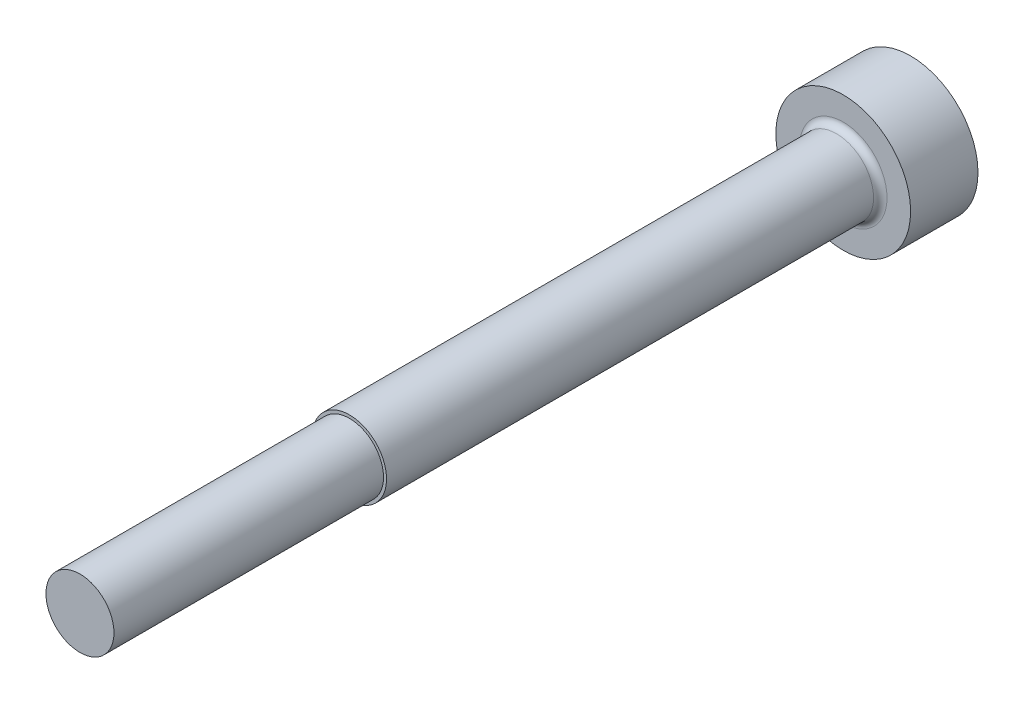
ISO-10303-21;
HEADER;
FILE_DESCRIPTION(('STEP AP214'),'2;1');
FILE_NAME('part.step','',(''),(''),'','','');
FILE_SCHEMA(('AUTOMOTIVE_DESIGN { 1 0 10303 214 1 1 1 1 }'));
ENDSEC;
DATA;
#1=APPLICATION_CONTEXT('core data for automotive mechanical design processes');
#2=APPLICATION_PROTOCOL_DEFINITION('international standard','automotive_design',2000,#1);
#3=PRODUCT_CONTEXT('',#1,'mechanical');
#4=PRODUCT('Part','Part','',(#3));
#5=PRODUCT_RELATED_PRODUCT_CATEGORY('part','',(#4));
#6=PRODUCT_DEFINITION_FORMATION('','',#4);
#7=PRODUCT_DEFINITION_CONTEXT('part definition',#1,'design');
#8=PRODUCT_DEFINITION('design','',#6,#7);
#9=PRODUCT_DEFINITION_SHAPE('','',#8);
#10=(LENGTH_UNIT() NAMED_UNIT(*) SI_UNIT(.MILLI.,.METRE.));
#11=(NAMED_UNIT(*) PLANE_ANGLE_UNIT() SI_UNIT($,.RADIAN.));
#12=(NAMED_UNIT(*) SI_UNIT($,.STERADIAN.) SOLID_ANGLE_UNIT());
#13=UNCERTAINTY_MEASURE_WITH_UNIT(LENGTH_MEASURE(1.E-05),#10,'distance_accuracy_value','');
#14=(GEOMETRIC_REPRESENTATION_CONTEXT(3) GLOBAL_UNCERTAINTY_ASSIGNED_CONTEXT((#13)) GLOBAL_UNIT_ASSIGNED_CONTEXT((#10,
#11,#12)) REPRESENTATION_CONTEXT('',''));
#15=CARTESIAN_POINT('',(0.,0.,0.));
#16=DIRECTION('',(0.,0.,1.));
#17=DIRECTION('',(1.,0.,0.));
#18=AXIS2_PLACEMENT_3D('',#15,#16,#17);
#19=CARTESIAN_POINT('',(0.,0.,203.111269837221));
#20=DIRECTION('',(0.,0.,-1.));
#21=DIRECTION('',(-1.,0.,0.));
#22=AXIS2_PLACEMENT_3D('',#19,#20,#21);
#23=CYLINDRICAL_SURFACE('',#22,1.1);
#24=CARTESIAN_POINT('',(0.,0.,2.20000000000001));
#25=DIRECTION('',(0.,0.,1.));
#26=DIRECTION('',(1.,0.,0.));
#27=AXIS2_PLACEMENT_3D('',#24,#25,#26);
#28=CIRCLE('',#27,1.1);
#29=CARTESIAN_POINT('',(-1.1,0.,2.20000000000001));
#30=VERTEX_POINT('',#29);
#31=EDGE_CURVE('E37',#30,#30,#28,.T.);
#32=CARTESIAN_POINT('',(0.,0.,16.65375));
#33=DIRECTION('',(0.,0.,1.));
#34=DIRECTION('',(1.,0.,0.));
#35=AXIS2_PLACEMENT_3D('',#32,#33,#34);
#36=CIRCLE('',#35,1.1);
#37=CARTESIAN_POINT('',(-1.1,0.,16.65375));
#38=VERTEX_POINT('',#37);
#39=EDGE_CURVE('E33',#38,#38,#36,.T.);
#40=CARTESIAN_POINT('',(-1.1,0.,2.20000000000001));
#41=CARTESIAN_POINT('',(-1.1,0.,2.35055989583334));
#42=CARTESIAN_POINT('',(-1.1,0.,2.50111979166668));
#43=CARTESIAN_POINT('',(-1.1,0.,2.80223958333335));
#44=CARTESIAN_POINT('',(-1.1,0.,2.95279947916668));
#45=CARTESIAN_POINT('',(-1.1,0.,3.25391927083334));
#46=CARTESIAN_POINT('',(-1.1,0.,3.40447916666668));
#47=CARTESIAN_POINT('',(-1.1,0.,3.70559895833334));
#48=CARTESIAN_POINT('',(-1.1,0.,3.85615885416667));
#49=CARTESIAN_POINT('',(-1.1,0.,4.15727864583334));
#50=CARTESIAN_POINT('',(-1.1,0.,4.30783854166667));
#51=CARTESIAN_POINT('',(-1.1,0.,4.60895833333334));
#52=CARTESIAN_POINT('',(-1.1,0.,4.75951822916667));
#53=CARTESIAN_POINT('',(-1.1,0.,5.06063802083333));
#54=CARTESIAN_POINT('',(-1.1,0.,5.21119791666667));
#55=CARTESIAN_POINT('',(-1.1,0.,5.51231770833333));
#56=CARTESIAN_POINT('',(-1.1,0.,5.66287760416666));
#57=CARTESIAN_POINT('',(-1.1,0.,5.96399739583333));
#58=CARTESIAN_POINT('',(-1.1,0.,6.11455729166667));
#59=CARTESIAN_POINT('',(-1.1,0.,6.41567708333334));
#60=CARTESIAN_POINT('',(-1.1,0.,6.56623697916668));
#61=CARTESIAN_POINT('',(-1.1,0.,6.86735677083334));
#62=CARTESIAN_POINT('',(-1.1,0.,7.01791666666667));
#63=CARTESIAN_POINT('',(-1.1,0.,7.31903645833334));
#64=CARTESIAN_POINT('',(-1.1,0.,7.46959635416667));
#65=CARTESIAN_POINT('',(-1.1,0.,7.77071614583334));
#66=CARTESIAN_POINT('',(-1.1,0.,7.92127604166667));
#67=CARTESIAN_POINT('',(-1.1,0.,8.22239583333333));
#68=CARTESIAN_POINT('',(-1.1,0.,8.37295572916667));
#69=CARTESIAN_POINT('',(-1.1,0.,8.67407552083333));
#70=CARTESIAN_POINT('',(-1.1,0.,8.82463541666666));
#71=CARTESIAN_POINT('',(-1.1,0.,9.12575520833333));
#72=CARTESIAN_POINT('',(-1.1,0.,9.27631510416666));
#73=CARTESIAN_POINT('',(-1.1,0.,9.57743489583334));
#74=CARTESIAN_POINT('',(-1.1,0.,9.72799479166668));
#75=CARTESIAN_POINT('',(-1.1,0.,10.0291145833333));
#76=CARTESIAN_POINT('',(-1.1,0.,10.1796744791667));
#77=CARTESIAN_POINT('',(-1.1,0.,10.4807942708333));
#78=CARTESIAN_POINT('',(-1.1,0.,10.6313541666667));
#79=CARTESIAN_POINT('',(-1.1,0.,10.9324739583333));
#80=CARTESIAN_POINT('',(-1.1,0.,11.0830338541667));
#81=CARTESIAN_POINT('',(-1.1,0.,11.3841536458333));
#82=CARTESIAN_POINT('',(-1.1,0.,11.5347135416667));
#83=CARTESIAN_POINT('',(-1.1,0.,11.8358333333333));
#84=CARTESIAN_POINT('',(-1.1,0.,11.9863932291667));
#85=CARTESIAN_POINT('',(-1.1,0.,12.2875130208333));
#86=CARTESIAN_POINT('',(-1.1,0.,12.4380729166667));
#87=CARTESIAN_POINT('',(-1.1,0.,12.7391927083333));
#88=CARTESIAN_POINT('',(-1.1,0.,12.8897526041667));
#89=CARTESIAN_POINT('',(-1.1,0.,13.1908723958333));
#90=CARTESIAN_POINT('',(-1.1,0.,13.3414322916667));
#91=CARTESIAN_POINT('',(-1.1,0.,13.6425520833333));
#92=CARTESIAN_POINT('',(-1.1,0.,13.7931119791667));
#93=CARTESIAN_POINT('',(-1.1,0.,14.0942317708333));
#94=CARTESIAN_POINT('',(-1.1,0.,14.2447916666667));
#95=CARTESIAN_POINT('',(-1.1,0.,14.5459114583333));
#96=CARTESIAN_POINT('',(-1.1,0.,14.6964713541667));
#97=CARTESIAN_POINT('',(-1.1,0.,14.9975911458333));
#98=CARTESIAN_POINT('',(-1.1,0.,15.1481510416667));
#99=CARTESIAN_POINT('',(-1.1,0.,15.4492708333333));
#100=CARTESIAN_POINT('',(-1.1,0.,15.5998307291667));
#101=CARTESIAN_POINT('',(-1.1,0.,15.9009505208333));
#102=CARTESIAN_POINT('',(-1.1,0.,16.0515104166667));
#103=CARTESIAN_POINT('',(-1.1,0.,16.3526302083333));
#104=CARTESIAN_POINT('',(-1.1,0.,16.5031901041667));
#105=CARTESIAN_POINT('',(-1.1,0.,16.65375));
#106=B_SPLINE_CURVE_WITH_KNOTS('',3,(#40,#41,#42,#43,#44,#45,#46,#47,#48,#49,#50,#51,#52,#53,
#54,#55,#56,#57,#58,#59,#60,#61,#62,#63,#64,#65,#66,#67,#68,#69,#70,#71,#72,#73,#74,#75,#76,#77,
#78,#79,#80,#81,#82,#83,#84,#85,#86,#87,#88,#89,#90,#91,#92,#93,#94,#95,#96,#97,#98,#99,#100,
#101,#102,#103,#104,#105),.UNSPECIFIED.,.F.,.F.,(4,2,2,2,2,2,2,2,2,2,2,2,2,2,2,2,2,2,2,2,2,2,2,
2,2,2,2,2,2,2,2,2,4),(0.,0.451679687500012,0.903359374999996,1.35503906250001,1.80671874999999,
2.2583984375,2.71007812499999,3.1617578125,3.61343749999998,4.06511718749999,4.51679687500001,
4.96847656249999,5.42015625,5.87183593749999,6.323515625,6.77519531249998,7.22687499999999,
7.67855468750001,8.13023437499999,8.5819140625,9.03359374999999,9.4852734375,9.93695312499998,
10.3886328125,10.8403125,11.2919921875,11.743671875,12.1953515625,12.64703125,13.0987109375,
13.550390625,14.0020703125,14.45375),.UNSPECIFIED.);
#107=EDGE_CURVE('BSEAM29',#30,#38,#106,.T.);
#108=ORIENTED_EDGE('',*,*,#31,.T.);
#109=ORIENTED_EDGE('',*,*,#39,.F.);
#110=ORIENTED_EDGE('',*,*,#107,.T.);
#111=ORIENTED_EDGE('',*,*,#107,.F.);
#112=EDGE_LOOP('',(#108,#110,#109,#111));
#113=FACE_BOUND('',#112,.T.);
#114=ADVANCED_FACE('F29',(#113),#23,.T.);
#115=CARTESIAN_POINT('',(0.,0.,2.));
#116=DIRECTION('',(0.,0.,1.));
#117=DIRECTION('',(1.,0.,0.));
#118=AXIS2_PLACEMENT_3D('',#115,#116,#117);
#119=PLANE('',#118);
#120=CARTESIAN_POINT('',(0.,0.,2.));
#121=DIRECTION('',(0.,0.,1.));
#122=DIRECTION('',(1.,0.,0.));
#123=AXIS2_PLACEMENT_3D('',#120,#121,#122);
#124=CIRCLE('',#123,1.3);
#125=CARTESIAN_POINT('',(1.3,0.,2.));
#126=VERTEX_POINT('',#125);
#127=EDGE_CURVE('E11',#126,#126,#124,.F.);
#128=ORIENTED_EDGE('',*,*,#127,.T.);
#129=EDGE_LOOP('',(#128));
#130=FACE_BOUND('',#129,.T.);
#131=CARTESIAN_POINT('',(0.,0.,2.));
#132=DIRECTION('',(0.,0.,1.));
#133=DIRECTION('',(1.,0.,0.));
#134=AXIS2_PLACEMENT_3D('',#131,#132,#133);
#135=CIRCLE('',#134,2.);
#136=CARTESIAN_POINT('',(2.,0.,2.));
#137=VERTEX_POINT('',#136);
#138=EDGE_CURVE('E41',#137,#137,#135,.T.);
#139=ORIENTED_EDGE('',*,*,#138,.T.);
#140=EDGE_LOOP('',(#139));
#141=FACE_BOUND('',#140,.T.);
#142=ADVANCED_FACE('F73',(#130,#141),#119,.T.);
#143=CARTESIAN_POINT('',(0.,0.,2.));
#144=DIRECTION('',(0.,0.,-1.));
#145=DIRECTION('',(-1.,0.,0.));
#146=AXIS2_PLACEMENT_3D('',#143,#144,#145);
#147=CYLINDRICAL_SURFACE('',#146,2.);
#148=ORIENTED_EDGE('',*,*,#138,.F.);
#149=EDGE_LOOP('',(#148));
#150=FACE_BOUND('',#149,.T.);
#151=CARTESIAN_POINT('',(0.,0.,0.));
#152=DIRECTION('',(0.,0.,1.));
#153=DIRECTION('',(1.,0.,0.));
#154=AXIS2_PLACEMENT_3D('',#151,#152,#153);
#155=CIRCLE('',#154,2.);
#156=CARTESIAN_POINT('',(2.,0.,0.));
#157=VERTEX_POINT('',#156);
#158=EDGE_CURVE('E46',#157,#157,#155,.T.);
#159=ORIENTED_EDGE('',*,*,#158,.T.);
#160=EDGE_LOOP('',(#159));
#161=FACE_BOUND('',#160,.T.);
#162=ADVANCED_FACE('F31',(#150,#161),#147,.T.);
#163=CARTESIAN_POINT('',(0.,0.,0.));
#164=DIRECTION('',(0.,0.,1.));
#165=DIRECTION('',(1.,0.,0.));
#166=AXIS2_PLACEMENT_3D('',#163,#164,#165);
#167=PLANE('',#166);
#168=ORIENTED_EDGE('',*,*,#158,.F.);
#169=EDGE_LOOP('',(#168));
#170=FACE_BOUND('',#169,.T.);
#171=ADVANCED_FACE('F82',(#170),#167,.F.);
#172=CARTESIAN_POINT('',(0.,0.,2.20000000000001));
#173=DIRECTION('',(0.,0.,1.));
#174=DIRECTION('',(1.,0.,0.));
#175=AXIS2_PLACEMENT_3D('',#172,#173,#174);
#176=TOROIDAL_SURFACE('',#175,1.3,0.2);
#177=ORIENTED_EDGE('',*,*,#127,.F.);
#178=EDGE_LOOP('',(#177));
#179=FACE_BOUND('',#178,.T.);
#180=ORIENTED_EDGE('',*,*,#31,.F.);
#181=EDGE_LOOP('',(#180));
#182=FACE_BOUND('',#181,.T.);
#183=ADVANCED_FACE('F68',(#179,#182),#176,.F.);
#184=CARTESIAN_POINT('',(7.282275,6.21285,16.65375));
#185=DIRECTION('',(0.,0.,1.));
#186=DIRECTION('',(1.,0.,0.));
#187=AXIS2_PLACEMENT_3D('',#184,#185,#186);
#188=PLANE('',#187);
#189=CARTESIAN_POINT('',(0.,0.,16.65375));
#190=DIRECTION('',(0.,0.,1.));
#191=DIRECTION('',(1.,0.,0.));
#192=AXIS2_PLACEMENT_3D('',#189,#190,#191);
#193=CIRCLE('',#192,1.00961168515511);
#194=CARTESIAN_POINT('',(1.00961168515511,0.,16.65375));
#195=VERTEX_POINT('',#194);
#196=EDGE_CURVE('E49',#195,#195,#193,.F.);
#197=ORIENTED_EDGE('',*,*,#196,.T.);
#198=EDGE_LOOP('',(#197));
#199=FACE_BOUND('',#198,.T.);
#200=ORIENTED_EDGE('',*,*,#39,.T.);
#201=EDGE_LOOP('',(#200));
#202=FACE_BOUND('',#201,.T.);
#203=ADVANCED_FACE('F60',(#199,#202),#188,.T.);
#204=CARTESIAN_POINT('',(0.,0.,8.94032720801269));
#205=DIRECTION('',(0.,0.,1.));
#206=DIRECTION('',(1.,0.,0.));
#207=AXIS2_PLACEMENT_3D('',#204,#205,#206);
#208=CYLINDRICAL_SURFACE('',#207,1.00961168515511);
#209=ORIENTED_EDGE('',*,*,#196,.F.);
#210=EDGE_LOOP('',(#209));
#211=FACE_BOUND('',#210,.T.);
#212=CARTESIAN_POINT('',(0.,0.,24.65375));
#213=DIRECTION('',(0.,0.,1.));
#214=DIRECTION('',(1.,0.,0.));
#215=AXIS2_PLACEMENT_3D('',#212,#213,#214);
#216=CIRCLE('',#215,1.00961168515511);
#217=CARTESIAN_POINT('',(1.00961168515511,0.,24.65375));
#218=VERTEX_POINT('',#217);
#219=EDGE_CURVE('E52',#218,#218,#216,.T.);
#220=ORIENTED_EDGE('',*,*,#219,.F.);
#221=EDGE_LOOP('',(#220));
#222=FACE_BOUND('',#221,.T.);
#223=ADVANCED_FACE('F58',(#211,#222),#208,.T.);
#224=CARTESIAN_POINT('',(7.282275,6.21285,24.65375));
#225=DIRECTION('',(0.,0.,1.));
#226=DIRECTION('',(1.,0.,0.));
#227=AXIS2_PLACEMENT_3D('',#224,#225,#226);
#228=PLANE('',#227);
#229=ORIENTED_EDGE('',*,*,#219,.T.);
#230=EDGE_LOOP('',(#229));
#231=FACE_BOUND('',#230,.T.);
#232=ADVANCED_FACE('F56',(#231),#228,.T.);
#233=CLOSED_SHELL('',(#114,#142,#162,#171,#183,#203,#223,#232));
#234=MANIFOLD_SOLID_BREP('B2',#233);
#235=ADVANCED_BREP_SHAPE_REPRESENTATION('',(#18,#234),#14);
#236=SHAPE_DEFINITION_REPRESENTATION(#9,#235);
ENDSEC;
END-ISO-10303-21;
